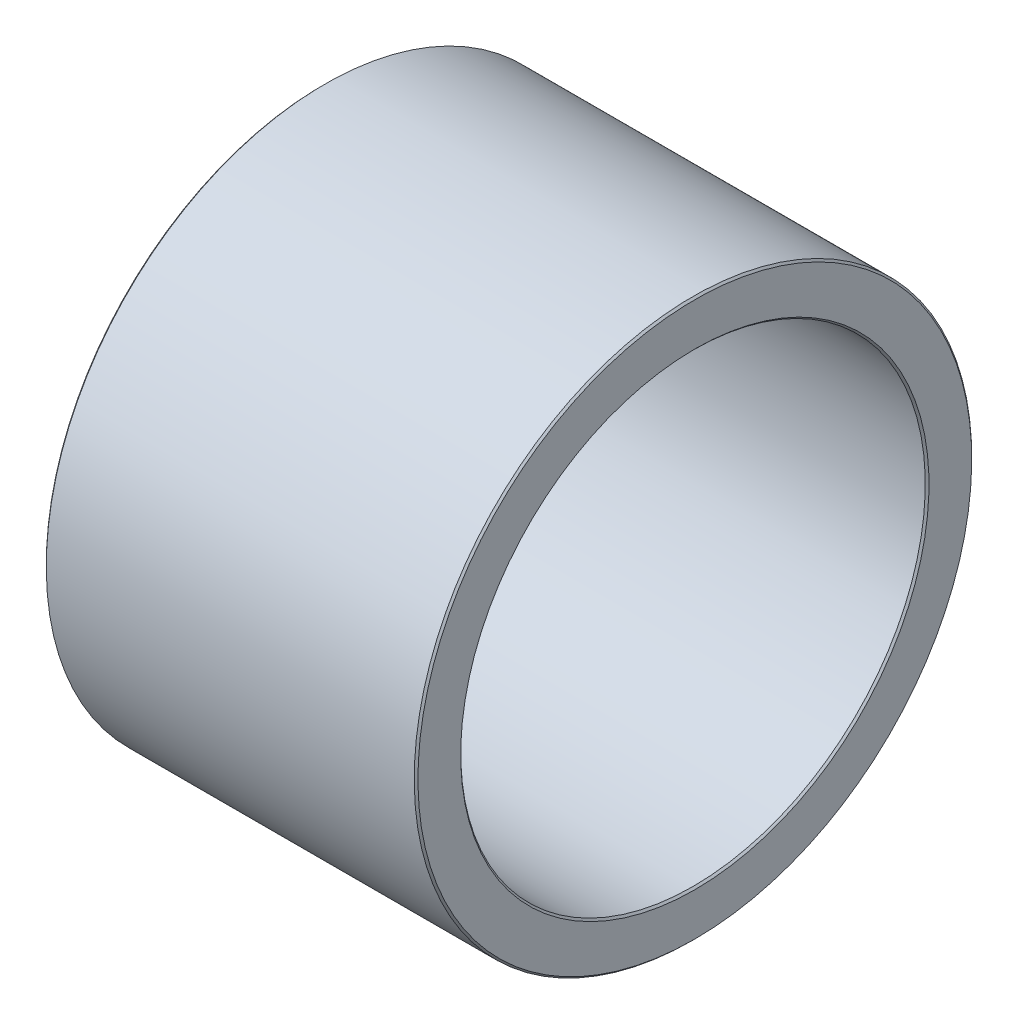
ISO-10303-21;
HEADER;
FILE_DESCRIPTION(('STEP AP214'),'2;1');
FILE_NAME('part.step','',(''),(''),'','','');
FILE_SCHEMA(('AUTOMOTIVE_DESIGN { 1 0 10303 214 1 1 1 1 }'));
ENDSEC;
DATA;
#1=APPLICATION_CONTEXT('core data for automotive mechanical design processes');
#2=APPLICATION_PROTOCOL_DEFINITION('international standard','automotive_design',2000,#1);
#3=PRODUCT_CONTEXT('',#1,'mechanical');
#4=PRODUCT('Part','Part','',(#3));
#5=PRODUCT_RELATED_PRODUCT_CATEGORY('part','',(#4));
#6=PRODUCT_DEFINITION_FORMATION('','',#4);
#7=PRODUCT_DEFINITION_CONTEXT('part definition',#1,'design');
#8=PRODUCT_DEFINITION('design','',#6,#7);
#9=PRODUCT_DEFINITION_SHAPE('','',#8);
#10=(LENGTH_UNIT() NAMED_UNIT(*) SI_UNIT(.MILLI.,.METRE.));
#11=(NAMED_UNIT(*) PLANE_ANGLE_UNIT() SI_UNIT($,.RADIAN.));
#12=(NAMED_UNIT(*) SI_UNIT($,.STERADIAN.) SOLID_ANGLE_UNIT());
#13=UNCERTAINTY_MEASURE_WITH_UNIT(LENGTH_MEASURE(1.E-05),#10,'distance_accuracy_value','');
#14=(GEOMETRIC_REPRESENTATION_CONTEXT(3) GLOBAL_UNCERTAINTY_ASSIGNED_CONTEXT((#13)) GLOBAL_UNIT_ASSIGNED_CONTEXT((#10,
#11,#12)) REPRESENTATION_CONTEXT('',''));
#15=CARTESIAN_POINT('',(0.,0.,0.));
#16=DIRECTION('',(0.,0.,1.));
#17=DIRECTION('',(1.,0.,0.));
#18=AXIS2_PLACEMENT_3D('',#15,#16,#17);
#19=CARTESIAN_POINT('',(0.,-55.,0.));
#20=DIRECTION('',(-1.,0.,0.));
#21=DIRECTION('',(0.,1.,0.));
#22=AXIS2_PLACEMENT_3D('',#19,#20,#21);
#23=PLANE('',#22);
#24=CARTESIAN_POINT('',(0.,0.,0.));
#25=DIRECTION('',(1.,0.,0.));
#26=DIRECTION('',(0.,-1.,0.));
#27=AXIS2_PLACEMENT_3D('',#24,#25,#26);
#28=CIRCLE('',#27,50.4);
#29=CARTESIAN_POINT('',(0.,-50.4,0.));
#30=VERTEX_POINT('',#29);
#31=EDGE_CURVE('E9',#30,#30,#28,.T.);
#32=ORIENTED_EDGE('',*,*,#31,.T.);
#33=EDGE_LOOP('',(#32));
#34=FACE_BOUND('',#33,.T.);
#35=CARTESIAN_POINT('',(0.,0.,0.));
#36=DIRECTION('',(1.,0.,0.));
#37=DIRECTION('',(0.,-1.,0.));
#38=AXIS2_PLACEMENT_3D('',#35,#36,#37);
#39=CIRCLE('',#38,59.6);
#40=CARTESIAN_POINT('',(0.,-59.6,0.));
#41=VERTEX_POINT('',#40);
#42=EDGE_CURVE('E61',#41,#41,#39,.T.);
#43=ORIENTED_EDGE('',*,*,#42,.F.);
#44=EDGE_LOOP('',(#43));
#45=FACE_BOUND('',#44,.T.);
#46=ADVANCED_FACE('F15',(#34,#45),#23,.T.);
#47=CARTESIAN_POINT('',(0.199999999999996,0.,0.));
#48=DIRECTION('',(-1.,0.,0.));
#49=DIRECTION('',(0.,-1.,0.));
#50=AXIS2_PLACEMENT_3D('',#47,#48,#49);
#51=CONICAL_SURFACE('',#50,50.2,0.785398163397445);
#52=CARTESIAN_POINT('',(0.4,0.,0.));
#53=DIRECTION('',(1.,0.,0.));
#54=DIRECTION('',(0.,-1.,0.));
#55=AXIS2_PLACEMENT_3D('',#52,#53,#54);
#56=CIRCLE('',#55,50.);
#57=CARTESIAN_POINT('',(0.4,-50.,0.));
#58=VERTEX_POINT('',#57);
#59=EDGE_CURVE('E18',#58,#58,#56,.T.);
#60=ORIENTED_EDGE('',*,*,#59,.T.);
#61=EDGE_LOOP('',(#60));
#62=FACE_BOUND('',#61,.T.);
#63=ORIENTED_EDGE('',*,*,#31,.F.);
#64=EDGE_LOOP('',(#63));
#65=FACE_BOUND('',#64,.T.);
#66=ADVANCED_FACE('F81',(#62,#65),#51,.F.);
#67=CARTESIAN_POINT('',(40.,0.,0.));
#68=DIRECTION('',(-1.,0.,0.));
#69=DIRECTION('',(0.,-1.,0.));
#70=AXIS2_PLACEMENT_3D('',#67,#68,#69);
#71=CYLINDRICAL_SURFACE('',#70,50.);
#72=CARTESIAN_POINT('',(79.6,0.,0.));
#73=DIRECTION('',(1.,0.,0.));
#74=DIRECTION('',(0.,-1.,0.));
#75=AXIS2_PLACEMENT_3D('',#72,#73,#74);
#76=CIRCLE('',#75,50.);
#77=CARTESIAN_POINT('',(79.6,-50.,0.));
#78=VERTEX_POINT('',#77);
#79=EDGE_CURVE('E54',#78,#78,#76,.T.);
#80=ORIENTED_EDGE('',*,*,#79,.T.);
#81=EDGE_LOOP('',(#80));
#82=FACE_BOUND('',#81,.T.);
#83=ORIENTED_EDGE('',*,*,#59,.F.);
#84=EDGE_LOOP('',(#83));
#85=FACE_BOUND('',#84,.T.);
#86=ADVANCED_FACE('F85',(#82,#85),#71,.F.);
#87=CARTESIAN_POINT('',(79.8,0.,0.));
#88=DIRECTION('',(1.,0.,0.));
#89=DIRECTION('',(0.,-1.,0.));
#90=AXIS2_PLACEMENT_3D('',#87,#88,#89);
#91=CONICAL_SURFACE('',#90,50.2,0.78539816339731);
#92=CARTESIAN_POINT('',(80.,0.,0.));
#93=DIRECTION('',(1.,0.,0.));
#94=DIRECTION('',(0.,-1.,0.));
#95=AXIS2_PLACEMENT_3D('',#92,#93,#94);
#96=CIRCLE('',#95,50.4);
#97=CARTESIAN_POINT('',(80.,-50.4,0.));
#98=VERTEX_POINT('',#97);
#99=EDGE_CURVE('E50',#98,#98,#96,.T.);
#100=ORIENTED_EDGE('',*,*,#99,.T.);
#101=EDGE_LOOP('',(#100));
#102=FACE_BOUND('',#101,.T.);
#103=ORIENTED_EDGE('',*,*,#79,.F.);
#104=EDGE_LOOP('',(#103));
#105=FACE_BOUND('',#104,.T.);
#106=ADVANCED_FACE('F51',(#102,#105),#91,.F.);
#107=CARTESIAN_POINT('',(80.,-55.,0.));
#108=DIRECTION('',(1.,0.,0.));
#109=DIRECTION('',(0.,-1.,0.));
#110=AXIS2_PLACEMENT_3D('',#107,#108,#109);
#111=PLANE('',#110);
#112=CARTESIAN_POINT('',(80.,0.,0.));
#113=DIRECTION('',(1.,0.,0.));
#114=DIRECTION('',(0.,-1.,0.));
#115=AXIS2_PLACEMENT_3D('',#112,#113,#114);
#116=CIRCLE('',#115,59.6);
#117=CARTESIAN_POINT('',(80.,-59.6,0.));
#118=VERTEX_POINT('',#117);
#119=EDGE_CURVE('E55',#118,#118,#116,.T.);
#120=ORIENTED_EDGE('',*,*,#119,.T.);
#121=EDGE_LOOP('',(#120));
#122=FACE_BOUND('',#121,.T.);
#123=ORIENTED_EDGE('',*,*,#99,.F.);
#124=EDGE_LOOP('',(#123));
#125=FACE_BOUND('',#124,.T.);
#126=ADVANCED_FACE('F97',(#122,#125),#111,.T.);
#127=CARTESIAN_POINT('',(79.8,0.,0.));
#128=DIRECTION('',(-1.,0.,0.));
#129=DIRECTION('',(0.,-1.,0.));
#130=AXIS2_PLACEMENT_3D('',#127,#128,#129);
#131=CONICAL_SURFACE('',#130,59.8,0.78539816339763);
#132=CARTESIAN_POINT('',(79.6,0.,0.));
#133=DIRECTION('',(1.,0.,0.));
#134=DIRECTION('',(0.,-1.,0.));
#135=AXIS2_PLACEMENT_3D('',#132,#133,#134);
#136=CIRCLE('',#135,60.);
#137=CARTESIAN_POINT('',(79.6,-60.,0.));
#138=VERTEX_POINT('',#137);
#139=EDGE_CURVE('E57',#138,#138,#136,.T.);
#140=ORIENTED_EDGE('',*,*,#139,.T.);
#141=EDGE_LOOP('',(#140));
#142=FACE_BOUND('',#141,.T.);
#143=ORIENTED_EDGE('',*,*,#119,.F.);
#144=EDGE_LOOP('',(#143));
#145=FACE_BOUND('',#144,.T.);
#146=ADVANCED_FACE('F77',(#142,#145),#131,.T.);
#147=CARTESIAN_POINT('',(40.,0.,0.));
#148=DIRECTION('',(-1.,0.,0.));
#149=DIRECTION('',(0.,-1.,0.));
#150=AXIS2_PLACEMENT_3D('',#147,#148,#149);
#151=CYLINDRICAL_SURFACE('',#150,60.);
#152=CARTESIAN_POINT('',(0.4,0.,0.));
#153=DIRECTION('',(1.,0.,0.));
#154=DIRECTION('',(0.,-1.,0.));
#155=AXIS2_PLACEMENT_3D('',#152,#153,#154);
#156=CIRCLE('',#155,60.);
#157=CARTESIAN_POINT('',(0.4,-60.,0.));
#158=VERTEX_POINT('',#157);
#159=EDGE_CURVE('E62',#158,#158,#156,.T.);
#160=ORIENTED_EDGE('',*,*,#159,.T.);
#161=EDGE_LOOP('',(#160));
#162=FACE_BOUND('',#161,.T.);
#163=ORIENTED_EDGE('',*,*,#139,.F.);
#164=EDGE_LOOP('',(#163));
#165=FACE_BOUND('',#164,.T.);
#166=ADVANCED_FACE('F66',(#162,#165),#151,.T.);
#167=CARTESIAN_POINT('',(0.200000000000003,0.,0.));
#168=DIRECTION('',(1.,0.,0.));
#169=DIRECTION('',(0.,-1.,0.));
#170=AXIS2_PLACEMENT_3D('',#167,#168,#169);
#171=CONICAL_SURFACE('',#170,59.8,0.785398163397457);
#172=ORIENTED_EDGE('',*,*,#42,.T.);
#173=EDGE_LOOP('',(#172));
#174=FACE_BOUND('',#173,.T.);
#175=ORIENTED_EDGE('',*,*,#159,.F.);
#176=EDGE_LOOP('',(#175));
#177=FACE_BOUND('',#176,.T.);
#178=ADVANCED_FACE('F69',(#174,#177),#171,.T.);
#179=CLOSED_SHELL('',(#46,#66,#86,#106,#126,#146,#166,#178));
#180=MANIFOLD_SOLID_BREP('B1',#179);
#181=ADVANCED_BREP_SHAPE_REPRESENTATION('',(#18,#180),#14);
#182=SHAPE_DEFINITION_REPRESENTATION(#9,#181);
ENDSEC;
END-ISO-10303-21;
